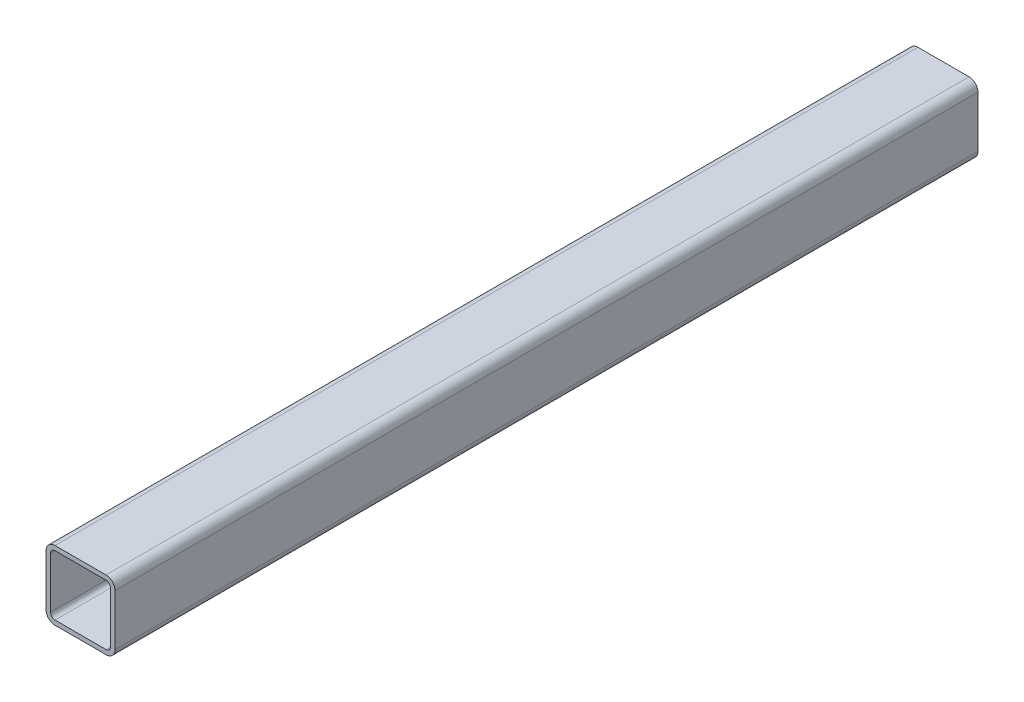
ISO-10303-21;
HEADER;
FILE_DESCRIPTION(('STEP AP214'),'2;1');
FILE_NAME('part.step','',(''),(''),'','','');
FILE_SCHEMA(('AUTOMOTIVE_DESIGN { 1 0 10303 214 1 1 1 1 }'));
ENDSEC;
DATA;
#1=APPLICATION_CONTEXT('core data for automotive mechanical design processes');
#2=APPLICATION_PROTOCOL_DEFINITION('international standard','automotive_design',2000,#1);
#3=PRODUCT_CONTEXT('',#1,'mechanical');
#4=PRODUCT('Part','Part','',(#3));
#5=PRODUCT_RELATED_PRODUCT_CATEGORY('part','',(#4));
#6=PRODUCT_DEFINITION_FORMATION('','',#4);
#7=PRODUCT_DEFINITION_CONTEXT('part definition',#1,'design');
#8=PRODUCT_DEFINITION('design','',#6,#7);
#9=PRODUCT_DEFINITION_SHAPE('','',#8);
#10=(LENGTH_UNIT() NAMED_UNIT(*) SI_UNIT(.MILLI.,.METRE.));
#11=(NAMED_UNIT(*) PLANE_ANGLE_UNIT() SI_UNIT($,.RADIAN.));
#12=(NAMED_UNIT(*) SI_UNIT($,.STERADIAN.) SOLID_ANGLE_UNIT());
#13=UNCERTAINTY_MEASURE_WITH_UNIT(LENGTH_MEASURE(1.E-05),#10,'distance_accuracy_value','');
#14=(GEOMETRIC_REPRESENTATION_CONTEXT(3) GLOBAL_UNCERTAINTY_ASSIGNED_CONTEXT((#13)) GLOBAL_UNIT_ASSIGNED_CONTEXT((#10,
#11,#12)) REPRESENTATION_CONTEXT('',''));
#15=CARTESIAN_POINT('',(0.,0.,0.));
#16=DIRECTION('',(0.,0.,1.));
#17=DIRECTION('',(1.,0.,0.));
#18=AXIS2_PLACEMENT_3D('',#15,#16,#17);
#19=CARTESIAN_POINT('',(34.8,35.95,500.));
#20=DIRECTION('',(0.,0.,1.));
#21=DIRECTION('',(1.,0.,0.));
#22=AXIS2_PLACEMENT_3D('',#19,#20,#21);
#23=PLANE('',#22);
#24=CARTESIAN_POINT('',(34.8,35.95,500.));
#25=DIRECTION('',(0.,0.,1.));
#26=DIRECTION('',(1.,0.,0.));
#27=AXIS2_PLACEMENT_3D('',#24,#25,#26);
#28=CIRCLE('',#27,5.2);
#29=CARTESIAN_POINT('',(40.,35.95,500.));
#30=VERTEX_POINT('',#29);
#31=CARTESIAN_POINT('',(34.8,41.15,500.));
#32=VERTEX_POINT('',#31);
#33=EDGE_CURVE('E208',#30,#32,#28,.T.);
#34=ORIENTED_EDGE('',*,*,#33,.T.);
#35=DIRECTION('',(-1.,0.,0.));
#36=VECTOR('',#35,1.);
#37=CARTESIAN_POINT('',(34.8,41.15,500.));
#38=LINE('',#37,#36);
#39=CARTESIAN_POINT('',(5.2,41.15,500.));
#40=VERTEX_POINT('',#39);
#41=EDGE_CURVE('E211',#32,#40,#38,.T.);
#42=ORIENTED_EDGE('',*,*,#41,.T.);
#43=CARTESIAN_POINT('',(5.2,35.95,500.));
#44=DIRECTION('',(0.,0.,1.));
#45=DIRECTION('',(1.,0.,0.));
#46=AXIS2_PLACEMENT_3D('',#43,#44,#45);
#47=CIRCLE('',#46,5.2);
#48=CARTESIAN_POINT('',(0.,35.95,500.));
#49=VERTEX_POINT('',#48);
#50=EDGE_CURVE('E214',#40,#49,#47,.T.);
#51=ORIENTED_EDGE('',*,*,#50,.T.);
#52=DIRECTION('',(0.,-1.,0.));
#53=VECTOR('',#52,1.);
#54=CARTESIAN_POINT('',(0.,6.35,500.));
#55=LINE('',#54,#53);
#56=CARTESIAN_POINT('',(0.,6.35,500.));
#57=VERTEX_POINT('',#56);
#58=EDGE_CURVE('E216',#49,#57,#55,.T.);
#59=ORIENTED_EDGE('',*,*,#58,.T.);
#60=CARTESIAN_POINT('',(5.2,6.35,500.));
#61=DIRECTION('',(0.,0.,1.));
#62=DIRECTION('',(1.,0.,0.));
#63=AXIS2_PLACEMENT_3D('',#60,#61,#62);
#64=CIRCLE('',#63,5.2);
#65=CARTESIAN_POINT('',(5.2,1.15,500.));
#66=VERTEX_POINT('',#65);
#67=EDGE_CURVE('E218',#57,#66,#64,.T.);
#68=ORIENTED_EDGE('',*,*,#67,.T.);
#69=DIRECTION('',(1.,0.,0.));
#70=VECTOR('',#69,1.);
#71=CARTESIAN_POINT('',(5.2,1.15,500.));
#72=LINE('',#71,#70);
#73=CARTESIAN_POINT('',(34.8,1.14999999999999,500.));
#74=VERTEX_POINT('',#73);
#75=EDGE_CURVE('E220',#66,#74,#72,.T.);
#76=ORIENTED_EDGE('',*,*,#75,.T.);
#77=CARTESIAN_POINT('',(34.8,6.34999999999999,500.));
#78=DIRECTION('',(0.,0.,1.));
#79=DIRECTION('',(1.,0.,0.));
#80=AXIS2_PLACEMENT_3D('',#77,#78,#79);
#81=CIRCLE('',#80,5.2);
#82=CARTESIAN_POINT('',(40.,6.35,500.));
#83=VERTEX_POINT('',#82);
#84=EDGE_CURVE('E222',#74,#83,#81,.T.);
#85=ORIENTED_EDGE('',*,*,#84,.T.);
#86=DIRECTION('',(0.,1.,0.));
#87=VECTOR('',#86,1.);
#88=CARTESIAN_POINT('',(40.,35.95,500.));
#89=LINE('',#88,#87);
#90=EDGE_CURVE('E224',#83,#30,#89,.T.);
#91=ORIENTED_EDGE('',*,*,#90,.T.);
#92=EDGE_LOOP('',(#34,#42,#51,#59,#68,#76,#85,#91));
#93=FACE_BOUND('',#92,.T.);
#94=DIRECTION('',(0.,-1.,0.));
#95=VECTOR('',#94,1.);
#96=CARTESIAN_POINT('',(2.6,6.35,500.));
#97=LINE('',#96,#95);
#98=CARTESIAN_POINT('',(2.6,35.95,500.));
#99=VERTEX_POINT('',#98);
#100=CARTESIAN_POINT('',(2.6,6.35,500.));
#101=VERTEX_POINT('',#100);
#102=EDGE_CURVE('E151',#99,#101,#97,.T.);
#103=ORIENTED_EDGE('',*,*,#102,.F.);
#104=CARTESIAN_POINT('',(5.2,35.95,500.));
#105=DIRECTION('',(0.,0.,1.));
#106=DIRECTION('',(1.,0.,0.));
#107=AXIS2_PLACEMENT_3D('',#104,#105,#106);
#108=CIRCLE('',#107,2.60000000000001);
#109=CARTESIAN_POINT('',(5.2,38.55,500.));
#110=VERTEX_POINT('',#109);
#111=EDGE_CURVE('E143',#110,#99,#108,.T.);
#112=ORIENTED_EDGE('',*,*,#111,.F.);
#113=DIRECTION('',(-1.,0.,0.));
#114=VECTOR('',#113,1.);
#115=CARTESIAN_POINT('',(34.8,38.55,500.));
#116=LINE('',#115,#114);
#117=CARTESIAN_POINT('',(34.8,38.55,500.));
#118=VERTEX_POINT('',#117);
#119=EDGE_CURVE('E176',#118,#110,#116,.T.);
#120=ORIENTED_EDGE('',*,*,#119,.F.);
#121=CARTESIAN_POINT('',(34.8,35.95,500.));
#122=DIRECTION('',(0.,0.,1.));
#123=DIRECTION('',(1.,0.,0.));
#124=AXIS2_PLACEMENT_3D('',#121,#122,#123);
#125=CIRCLE('',#124,2.59999999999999);
#126=CARTESIAN_POINT('',(37.4,35.95,500.));
#127=VERTEX_POINT('',#126);
#128=EDGE_CURVE('E174',#127,#118,#125,.T.);
#129=ORIENTED_EDGE('',*,*,#128,.F.);
#130=DIRECTION('',(0.,1.,0.));
#131=VECTOR('',#130,1.);
#132=CARTESIAN_POINT('',(37.4,35.95,500.));
#133=LINE('',#132,#131);
#134=CARTESIAN_POINT('',(37.4,6.35,500.));
#135=VERTEX_POINT('',#134);
#136=EDGE_CURVE('E172',#135,#127,#133,.T.);
#137=ORIENTED_EDGE('',*,*,#136,.F.);
#138=CARTESIAN_POINT('',(34.8,6.35,500.));
#139=DIRECTION('',(0.,0.,1.));
#140=DIRECTION('',(1.,0.,0.));
#141=AXIS2_PLACEMENT_3D('',#138,#139,#140);
#142=CIRCLE('',#141,2.6);
#143=CARTESIAN_POINT('',(34.8,3.75,500.));
#144=VERTEX_POINT('',#143);
#145=EDGE_CURVE('E170',#144,#135,#142,.T.);
#146=ORIENTED_EDGE('',*,*,#145,.F.);
#147=DIRECTION('',(1.,0.,0.));
#148=VECTOR('',#147,1.);
#149=CARTESIAN_POINT('',(5.2,3.75,500.));
#150=LINE('',#149,#148);
#151=CARTESIAN_POINT('',(5.2,3.75,500.));
#152=VERTEX_POINT('',#151);
#153=EDGE_CURVE('E166',#152,#144,#150,.T.);
#154=ORIENTED_EDGE('',*,*,#153,.F.);
#155=CARTESIAN_POINT('',(5.2,6.35,500.));
#156=DIRECTION('',(0.,0.,1.));
#157=DIRECTION('',(1.,0.,0.));
#158=AXIS2_PLACEMENT_3D('',#155,#156,#157);
#159=CIRCLE('',#158,2.6);
#160=EDGE_CURVE('E164',#101,#152,#159,.T.);
#161=ORIENTED_EDGE('',*,*,#160,.F.);
#162=EDGE_LOOP('',(#103,#112,#120,#129,#137,#146,#154,#161));
#163=FACE_BOUND('',#162,.T.);
#164=ADVANCED_FACE('F30',(#93,#163),#23,.T.);
#165=CARTESIAN_POINT('',(34.8,35.95,0.));
#166=DIRECTION('',(0.,0.,1.));
#167=DIRECTION('',(1.,0.,0.));
#168=AXIS2_PLACEMENT_3D('',#165,#166,#167);
#169=PLANE('',#168);
#170=CARTESIAN_POINT('',(34.8,35.95,0.));
#171=DIRECTION('',(0.,0.,1.));
#172=DIRECTION('',(1.,0.,0.));
#173=AXIS2_PLACEMENT_3D('',#170,#171,#172);
#174=CIRCLE('',#173,5.2);
#175=CARTESIAN_POINT('',(40.,35.95,0.));
#176=VERTEX_POINT('',#175);
#177=CARTESIAN_POINT('',(34.8,41.15,0.));
#178=VERTEX_POINT('',#177);
#179=EDGE_CURVE('E159',#176,#178,#174,.T.);
#180=ORIENTED_EDGE('',*,*,#179,.F.);
#181=DIRECTION('',(0.,1.,0.));
#182=VECTOR('',#181,1.);
#183=CARTESIAN_POINT('',(40.,35.95,0.));
#184=LINE('',#183,#182);
#185=CARTESIAN_POINT('',(40.,6.35,0.));
#186=VERTEX_POINT('',#185);
#187=EDGE_CURVE('E212',#186,#176,#184,.T.);
#188=ORIENTED_EDGE('',*,*,#187,.F.);
#189=CARTESIAN_POINT('',(34.8,6.34999999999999,0.));
#190=DIRECTION('',(0.,0.,1.));
#191=DIRECTION('',(1.,0.,0.));
#192=AXIS2_PLACEMENT_3D('',#189,#190,#191);
#193=CIRCLE('',#192,5.2);
#194=CARTESIAN_POINT('',(34.8,1.14999999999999,0.));
#195=VERTEX_POINT('',#194);
#196=EDGE_CURVE('E239',#195,#186,#193,.T.);
#197=ORIENTED_EDGE('',*,*,#196,.F.);
#198=DIRECTION('',(1.,0.,0.));
#199=VECTOR('',#198,1.);
#200=CARTESIAN_POINT('',(5.2,1.15,0.));
#201=LINE('',#200,#199);
#202=CARTESIAN_POINT('',(5.2,1.15,0.));
#203=VERTEX_POINT('',#202);
#204=EDGE_CURVE('E237',#203,#195,#201,.T.);
#205=ORIENTED_EDGE('',*,*,#204,.F.);
#206=CARTESIAN_POINT('',(5.2,6.35,0.));
#207=DIRECTION('',(0.,0.,1.));
#208=DIRECTION('',(1.,0.,0.));
#209=AXIS2_PLACEMENT_3D('',#206,#207,#208);
#210=CIRCLE('',#209,5.2);
#211=CARTESIAN_POINT('',(0.,6.35,0.));
#212=VERTEX_POINT('',#211);
#213=EDGE_CURVE('E235',#212,#203,#210,.T.);
#214=ORIENTED_EDGE('',*,*,#213,.F.);
#215=DIRECTION('',(0.,-1.,0.));
#216=VECTOR('',#215,1.);
#217=CARTESIAN_POINT('',(0.,6.35,0.));
#218=LINE('',#217,#216);
#219=CARTESIAN_POINT('',(0.,35.95,0.));
#220=VERTEX_POINT('',#219);
#221=EDGE_CURVE('E233',#220,#212,#218,.T.);
#222=ORIENTED_EDGE('',*,*,#221,.F.);
#223=CARTESIAN_POINT('',(5.2,35.95,0.));
#224=DIRECTION('',(0.,0.,1.));
#225=DIRECTION('',(1.,0.,0.));
#226=AXIS2_PLACEMENT_3D('',#223,#224,#225);
#227=CIRCLE('',#226,5.2);
#228=CARTESIAN_POINT('',(5.2,41.15,0.));
#229=VERTEX_POINT('',#228);
#230=EDGE_CURVE('E231',#229,#220,#227,.T.);
#231=ORIENTED_EDGE('',*,*,#230,.F.);
#232=DIRECTION('',(-1.,0.,0.));
#233=VECTOR('',#232,1.);
#234=CARTESIAN_POINT('',(34.8,41.15,0.));
#235=LINE('',#234,#233);
#236=EDGE_CURVE('E229',#178,#229,#235,.T.);
#237=ORIENTED_EDGE('',*,*,#236,.F.);
#238=EDGE_LOOP('',(#180,#188,#197,#205,#214,#222,#231,#237));
#239=FACE_BOUND('',#238,.T.);
#240=CARTESIAN_POINT('',(5.2,35.95,0.));
#241=DIRECTION('',(0.,0.,1.));
#242=DIRECTION('',(1.,0.,0.));
#243=AXIS2_PLACEMENT_3D('',#240,#241,#242);
#244=CIRCLE('',#243,2.60000000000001);
#245=CARTESIAN_POINT('',(5.2,38.55,0.));
#246=VERTEX_POINT('',#245);
#247=CARTESIAN_POINT('',(2.6,35.95,0.));
#248=VERTEX_POINT('',#247);
#249=EDGE_CURVE('E53',#246,#248,#244,.T.);
#250=ORIENTED_EDGE('',*,*,#249,.T.);
#251=DIRECTION('',(0.,-1.,0.));
#252=VECTOR('',#251,1.);
#253=CARTESIAN_POINT('',(2.6,6.35,0.));
#254=LINE('',#253,#252);
#255=CARTESIAN_POINT('',(2.6,6.35,0.));
#256=VERTEX_POINT('',#255);
#257=EDGE_CURVE('E158',#248,#256,#254,.T.);
#258=ORIENTED_EDGE('',*,*,#257,.T.);
#259=CARTESIAN_POINT('',(5.2,6.35,0.));
#260=DIRECTION('',(0.,0.,1.));
#261=DIRECTION('',(1.,0.,0.));
#262=AXIS2_PLACEMENT_3D('',#259,#260,#261);
#263=CIRCLE('',#262,2.6);
#264=CARTESIAN_POINT('',(5.2,3.75,0.));
#265=VERTEX_POINT('',#264);
#266=EDGE_CURVE('E180',#256,#265,#263,.T.);
#267=ORIENTED_EDGE('',*,*,#266,.T.);
#268=DIRECTION('',(1.,0.,0.));
#269=VECTOR('',#268,1.);
#270=CARTESIAN_POINT('',(5.2,3.75,0.));
#271=LINE('',#270,#269);
#272=CARTESIAN_POINT('',(34.8,3.75,0.));
#273=VERTEX_POINT('',#272);
#274=EDGE_CURVE('E183',#265,#273,#271,.T.);
#275=ORIENTED_EDGE('',*,*,#274,.T.);
#276=CARTESIAN_POINT('',(34.8,6.35,0.));
#277=DIRECTION('',(0.,0.,1.));
#278=DIRECTION('',(1.,0.,0.));
#279=AXIS2_PLACEMENT_3D('',#276,#277,#278);
#280=CIRCLE('',#279,2.6);
#281=CARTESIAN_POINT('',(37.4,6.35,0.));
#282=VERTEX_POINT('',#281);
#283=EDGE_CURVE('E186',#273,#282,#280,.T.);
#284=ORIENTED_EDGE('',*,*,#283,.T.);
#285=DIRECTION('',(0.,1.,0.));
#286=VECTOR('',#285,1.);
#287=CARTESIAN_POINT('',(37.4,35.95,0.));
#288=LINE('',#287,#286);
#289=CARTESIAN_POINT('',(37.4,35.95,0.));
#290=VERTEX_POINT('',#289);
#291=EDGE_CURVE('E189',#282,#290,#288,.T.);
#292=ORIENTED_EDGE('',*,*,#291,.T.);
#293=CARTESIAN_POINT('',(34.8,35.95,0.));
#294=DIRECTION('',(0.,0.,1.));
#295=DIRECTION('',(1.,0.,0.));
#296=AXIS2_PLACEMENT_3D('',#293,#294,#295);
#297=CIRCLE('',#296,2.59999999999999);
#298=CARTESIAN_POINT('',(34.8,38.55,0.));
#299=VERTEX_POINT('',#298);
#300=EDGE_CURVE('E192',#290,#299,#297,.T.);
#301=ORIENTED_EDGE('',*,*,#300,.T.);
#302=DIRECTION('',(-1.,0.,0.));
#303=VECTOR('',#302,1.);
#304=CARTESIAN_POINT('',(34.8,38.55,0.));
#305=LINE('',#304,#303);
#306=EDGE_CURVE('E152',#299,#246,#305,.T.);
#307=ORIENTED_EDGE('',*,*,#306,.T.);
#308=EDGE_LOOP('',(#250,#258,#267,#275,#284,#292,#301,#307));
#309=FACE_BOUND('',#308,.T.);
#310=ADVANCED_FACE('F269',(#239,#309),#169,.F.);
#311=CARTESIAN_POINT('',(34.8,35.95,500.));
#312=DIRECTION('',(0.,0.,-1.));
#313=DIRECTION('',(-1.,0.,0.));
#314=AXIS2_PLACEMENT_3D('',#311,#312,#313);
#315=CYLINDRICAL_SURFACE('',#314,5.2);
#316=ORIENTED_EDGE('',*,*,#179,.T.);
#317=DIRECTION('',(0.,0.,-1.));
#318=VECTOR('',#317,1.);
#319=CARTESIAN_POINT('',(34.8,41.15,500.));
#320=LINE('',#319,#318);
#321=EDGE_CURVE('E11',#32,#178,#320,.T.);
#322=ORIENTED_EDGE('',*,*,#321,.F.);
#323=ORIENTED_EDGE('',*,*,#33,.F.);
#324=DIRECTION('',(0.,0.,-1.));
#325=VECTOR('',#324,1.);
#326=CARTESIAN_POINT('',(40.,35.95,500.));
#327=LINE('',#326,#325);
#328=EDGE_CURVE('E226',#30,#176,#327,.T.);
#329=ORIENTED_EDGE('',*,*,#328,.T.);
#330=EDGE_LOOP('',(#316,#322,#323,#329));
#331=FACE_BOUND('',#330,.T.);
#332=ADVANCED_FACE('F32',(#331),#315,.T.);
#333=CARTESIAN_POINT('',(34.8,41.15,500.));
#334=DIRECTION('',(0.,-1.,0.));
#335=DIRECTION('',(1.,0.,0.));
#336=AXIS2_PLACEMENT_3D('',#333,#334,#335);
#337=PLANE('',#336);
#338=ORIENTED_EDGE('',*,*,#236,.T.);
#339=DIRECTION('',(0.,0.,-1.));
#340=VECTOR('',#339,1.);
#341=CARTESIAN_POINT('',(5.2,41.15,500.));
#342=LINE('',#341,#340);
#343=EDGE_CURVE('E38',#40,#229,#342,.T.);
#344=ORIENTED_EDGE('',*,*,#343,.F.);
#345=ORIENTED_EDGE('',*,*,#41,.F.);
#346=ORIENTED_EDGE('',*,*,#321,.T.);
#347=EDGE_LOOP('',(#338,#344,#345,#346));
#348=FACE_BOUND('',#347,.T.);
#349=ADVANCED_FACE('F286',(#348),#337,.F.);
#350=CARTESIAN_POINT('',(5.2,35.95,500.));
#351=DIRECTION('',(0.,0.,-1.));
#352=DIRECTION('',(-1.,0.,0.));
#353=AXIS2_PLACEMENT_3D('',#350,#351,#352);
#354=CYLINDRICAL_SURFACE('',#353,5.2);
#355=ORIENTED_EDGE('',*,*,#230,.T.);
#356=DIRECTION('',(0.,0.,-1.));
#357=VECTOR('',#356,1.);
#358=CARTESIAN_POINT('',(0.,35.95,500.));
#359=LINE('',#358,#357);
#360=EDGE_CURVE('E256',#49,#220,#359,.T.);
#361=ORIENTED_EDGE('',*,*,#360,.F.);
#362=ORIENTED_EDGE('',*,*,#50,.F.);
#363=ORIENTED_EDGE('',*,*,#343,.T.);
#364=EDGE_LOOP('',(#355,#361,#362,#363));
#365=FACE_BOUND('',#364,.T.);
#366=ADVANCED_FACE('F263',(#365),#354,.T.);
#367=CARTESIAN_POINT('',(0.,6.35,500.));
#368=DIRECTION('',(1.,0.,0.));
#369=DIRECTION('',(0.,1.,0.));
#370=AXIS2_PLACEMENT_3D('',#367,#368,#369);
#371=PLANE('',#370);
#372=ORIENTED_EDGE('',*,*,#221,.T.);
#373=DIRECTION('',(0.,0.,-1.));
#374=VECTOR('',#373,1.);
#375=CARTESIAN_POINT('',(0.,6.35,500.));
#376=LINE('',#375,#374);
#377=EDGE_CURVE('E253',#57,#212,#376,.T.);
#378=ORIENTED_EDGE('',*,*,#377,.F.);
#379=ORIENTED_EDGE('',*,*,#58,.F.);
#380=ORIENTED_EDGE('',*,*,#360,.T.);
#381=EDGE_LOOP('',(#372,#378,#379,#380));
#382=FACE_BOUND('',#381,.T.);
#383=ADVANCED_FACE('F275',(#382),#371,.F.);
#384=CARTESIAN_POINT('',(5.2,6.35,500.));
#385=DIRECTION('',(0.,0.,-1.));
#386=DIRECTION('',(-1.,0.,0.));
#387=AXIS2_PLACEMENT_3D('',#384,#385,#386);
#388=CYLINDRICAL_SURFACE('',#387,5.2);
#389=ORIENTED_EDGE('',*,*,#213,.T.);
#390=DIRECTION('',(0.,0.,-1.));
#391=VECTOR('',#390,1.);
#392=CARTESIAN_POINT('',(5.2,1.15,500.));
#393=LINE('',#392,#391);
#394=EDGE_CURVE('E250',#66,#203,#393,.T.);
#395=ORIENTED_EDGE('',*,*,#394,.F.);
#396=ORIENTED_EDGE('',*,*,#67,.F.);
#397=ORIENTED_EDGE('',*,*,#377,.T.);
#398=EDGE_LOOP('',(#389,#395,#396,#397));
#399=FACE_BOUND('',#398,.T.);
#400=ADVANCED_FACE('F279',(#399),#388,.T.);
#401=CARTESIAN_POINT('',(5.2,1.15,500.));
#402=DIRECTION('',(0.,1.,0.));
#403=DIRECTION('',(-1.,0.,0.));
#404=AXIS2_PLACEMENT_3D('',#401,#402,#403);
#405=PLANE('',#404);
#406=ORIENTED_EDGE('',*,*,#204,.T.);
#407=DIRECTION('',(0.,0.,-1.));
#408=VECTOR('',#407,1.);
#409=CARTESIAN_POINT('',(34.8,1.14999999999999,500.));
#410=LINE('',#409,#408);
#411=EDGE_CURVE('E247',#74,#195,#410,.T.);
#412=ORIENTED_EDGE('',*,*,#411,.F.);
#413=ORIENTED_EDGE('',*,*,#75,.F.);
#414=ORIENTED_EDGE('',*,*,#394,.T.);
#415=EDGE_LOOP('',(#406,#412,#413,#414));
#416=FACE_BOUND('',#415,.T.);
#417=ADVANCED_FACE('F299',(#416),#405,.F.);
#418=CARTESIAN_POINT('',(34.8,6.34999999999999,500.));
#419=DIRECTION('',(0.,0.,-1.));
#420=DIRECTION('',(-1.,0.,0.));
#421=AXIS2_PLACEMENT_3D('',#418,#419,#420);
#422=CYLINDRICAL_SURFACE('',#421,5.2);
#423=ORIENTED_EDGE('',*,*,#196,.T.);
#424=DIRECTION('',(0.,0.,-1.));
#425=VECTOR('',#424,1.);
#426=CARTESIAN_POINT('',(40.,6.35,500.));
#427=LINE('',#426,#425);
#428=EDGE_CURVE('E244',#83,#186,#427,.T.);
#429=ORIENTED_EDGE('',*,*,#428,.F.);
#430=ORIENTED_EDGE('',*,*,#84,.F.);
#431=ORIENTED_EDGE('',*,*,#411,.T.);
#432=EDGE_LOOP('',(#423,#429,#430,#431));
#433=FACE_BOUND('',#432,.T.);
#434=ADVANCED_FACE('F297',(#433),#422,.T.);
#435=CARTESIAN_POINT('',(40.,35.95,500.));
#436=DIRECTION('',(-1.,0.,0.));
#437=DIRECTION('',(0.,-1.,0.));
#438=AXIS2_PLACEMENT_3D('',#435,#436,#437);
#439=PLANE('',#438);
#440=ORIENTED_EDGE('',*,*,#187,.T.);
#441=ORIENTED_EDGE('',*,*,#328,.F.);
#442=ORIENTED_EDGE('',*,*,#90,.F.);
#443=ORIENTED_EDGE('',*,*,#428,.T.);
#444=EDGE_LOOP('',(#440,#441,#442,#443));
#445=FACE_BOUND('',#444,.T.);
#446=ADVANCED_FACE('F292',(#445),#439,.F.);
#447=CARTESIAN_POINT('',(5.2,35.95,500.));
#448=DIRECTION('',(0.,0.,-1.));
#449=DIRECTION('',(-1.,0.,0.));
#450=AXIS2_PLACEMENT_3D('',#447,#448,#449);
#451=CYLINDRICAL_SURFACE('',#450,2.60000000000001);
#452=ORIENTED_EDGE('',*,*,#249,.F.);
#453=DIRECTION('',(0.,0.,-1.));
#454=VECTOR('',#453,1.);
#455=CARTESIAN_POINT('',(5.2,38.55,500.));
#456=LINE('',#455,#454);
#457=EDGE_CURVE('E147',#110,#246,#456,.T.);
#458=ORIENTED_EDGE('',*,*,#457,.F.);
#459=ORIENTED_EDGE('',*,*,#111,.T.);
#460=DIRECTION('',(0.,0.,-1.));
#461=VECTOR('',#460,1.);
#462=CARTESIAN_POINT('',(2.6,35.95,500.));
#463=LINE('',#462,#461);
#464=EDGE_CURVE('E146',#99,#248,#463,.T.);
#465=ORIENTED_EDGE('',*,*,#464,.T.);
#466=EDGE_LOOP('',(#452,#458,#459,#465));
#467=FACE_BOUND('',#466,.T.);
#468=ADVANCED_FACE('F145',(#467),#451,.F.);
#469=CARTESIAN_POINT('',(2.6,6.35,500.));
#470=DIRECTION('',(1.,0.,0.));
#471=DIRECTION('',(0.,0.,-1.));
#472=AXIS2_PLACEMENT_3D('',#469,#470,#471);
#473=PLANE('',#472);
#474=ORIENTED_EDGE('',*,*,#257,.F.);
#475=ORIENTED_EDGE('',*,*,#464,.F.);
#476=ORIENTED_EDGE('',*,*,#102,.T.);
#477=DIRECTION('',(0.,0.,-1.));
#478=VECTOR('',#477,1.);
#479=CARTESIAN_POINT('',(2.6,6.35,500.));
#480=LINE('',#479,#478);
#481=EDGE_CURVE('E160',#101,#256,#480,.T.);
#482=ORIENTED_EDGE('',*,*,#481,.T.);
#483=EDGE_LOOP('',(#474,#475,#476,#482));
#484=FACE_BOUND('',#483,.T.);
#485=ADVANCED_FACE('F155',(#484),#473,.T.);
#486=CARTESIAN_POINT('',(5.2,6.35,500.));
#487=DIRECTION('',(0.,0.,-1.));
#488=DIRECTION('',(-1.,0.,0.));
#489=AXIS2_PLACEMENT_3D('',#486,#487,#488);
#490=CYLINDRICAL_SURFACE('',#489,2.6);
#491=ORIENTED_EDGE('',*,*,#266,.F.);
#492=ORIENTED_EDGE('',*,*,#481,.F.);
#493=ORIENTED_EDGE('',*,*,#160,.T.);
#494=DIRECTION('',(0.,0.,-1.));
#495=VECTOR('',#494,1.);
#496=CARTESIAN_POINT('',(5.2,3.75,500.));
#497=LINE('',#496,#495);
#498=EDGE_CURVE('E205',#152,#265,#497,.T.);
#499=ORIENTED_EDGE('',*,*,#498,.T.);
#500=EDGE_LOOP('',(#491,#492,#493,#499));
#501=FACE_BOUND('',#500,.T.);
#502=ADVANCED_FACE('F324',(#501),#490,.F.);
#503=CARTESIAN_POINT('',(5.2,3.75,500.));
#504=DIRECTION('',(0.,1.,0.));
#505=DIRECTION('',(0.,0.,1.));
#506=AXIS2_PLACEMENT_3D('',#503,#504,#505);
#507=PLANE('',#506);
#508=ORIENTED_EDGE('',*,*,#274,.F.);
#509=ORIENTED_EDGE('',*,*,#498,.F.);
#510=ORIENTED_EDGE('',*,*,#153,.T.);
#511=DIRECTION('',(0.,0.,-1.));
#512=VECTOR('',#511,1.);
#513=CARTESIAN_POINT('',(34.8,3.75,500.));
#514=LINE('',#513,#512);
#515=EDGE_CURVE('E203',#144,#273,#514,.T.);
#516=ORIENTED_EDGE('',*,*,#515,.T.);
#517=EDGE_LOOP('',(#508,#509,#510,#516));
#518=FACE_BOUND('',#517,.T.);
#519=ADVANCED_FACE('F328',(#518),#507,.T.);
#520=CARTESIAN_POINT('',(34.8,6.35,500.));
#521=DIRECTION('',(0.,0.,-1.));
#522=DIRECTION('',(-1.,0.,0.));
#523=AXIS2_PLACEMENT_3D('',#520,#521,#522);
#524=CYLINDRICAL_SURFACE('',#523,2.6);
#525=ORIENTED_EDGE('',*,*,#283,.F.);
#526=ORIENTED_EDGE('',*,*,#515,.F.);
#527=ORIENTED_EDGE('',*,*,#145,.T.);
#528=DIRECTION('',(0.,0.,-1.));
#529=VECTOR('',#528,1.);
#530=CARTESIAN_POINT('',(37.4,6.35,500.));
#531=LINE('',#530,#529);
#532=EDGE_CURVE('E201',#135,#282,#531,.T.);
#533=ORIENTED_EDGE('',*,*,#532,.T.);
#534=EDGE_LOOP('',(#525,#526,#527,#533));
#535=FACE_BOUND('',#534,.T.);
#536=ADVANCED_FACE('F334',(#535),#524,.F.);
#537=CARTESIAN_POINT('',(37.4,35.95,500.));
#538=DIRECTION('',(-1.,0.,0.));
#539=DIRECTION('',(0.,-1.,0.));
#540=AXIS2_PLACEMENT_3D('',#537,#538,#539);
#541=PLANE('',#540);
#542=ORIENTED_EDGE('',*,*,#291,.F.);
#543=ORIENTED_EDGE('',*,*,#532,.F.);
#544=ORIENTED_EDGE('',*,*,#136,.T.);
#545=DIRECTION('',(0.,0.,-1.));
#546=VECTOR('',#545,1.);
#547=CARTESIAN_POINT('',(37.4,35.95,500.));
#548=LINE('',#547,#546);
#549=EDGE_CURVE('E199',#127,#290,#548,.T.);
#550=ORIENTED_EDGE('',*,*,#549,.T.);
#551=EDGE_LOOP('',(#542,#543,#544,#550));
#552=FACE_BOUND('',#551,.T.);
#553=ADVANCED_FACE('F338',(#552),#541,.T.);
#554=CARTESIAN_POINT('',(34.8,35.95,500.));
#555=DIRECTION('',(0.,0.,-1.));
#556=DIRECTION('',(-1.,0.,0.));
#557=AXIS2_PLACEMENT_3D('',#554,#555,#556);
#558=CYLINDRICAL_SURFACE('',#557,2.59999999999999);
#559=ORIENTED_EDGE('',*,*,#300,.F.);
#560=ORIENTED_EDGE('',*,*,#549,.F.);
#561=ORIENTED_EDGE('',*,*,#128,.T.);
#562=DIRECTION('',(0.,0.,-1.));
#563=VECTOR('',#562,1.);
#564=CARTESIAN_POINT('',(34.8,38.55,500.));
#565=LINE('',#564,#563);
#566=EDGE_CURVE('E45',#118,#299,#565,.T.);
#567=ORIENTED_EDGE('',*,*,#566,.T.);
#568=EDGE_LOOP('',(#559,#560,#561,#567));
#569=FACE_BOUND('',#568,.T.);
#570=ADVANCED_FACE('F342',(#569),#558,.F.);
#571=CARTESIAN_POINT('',(34.8,38.55,500.));
#572=DIRECTION('',(0.,-1.,0.));
#573=DIRECTION('',(0.,0.,-1.));
#574=AXIS2_PLACEMENT_3D('',#571,#572,#573);
#575=PLANE('',#574);
#576=ORIENTED_EDGE('',*,*,#306,.F.);
#577=ORIENTED_EDGE('',*,*,#566,.F.);
#578=ORIENTED_EDGE('',*,*,#119,.T.);
#579=ORIENTED_EDGE('',*,*,#457,.T.);
#580=EDGE_LOOP('',(#576,#577,#578,#579));
#581=FACE_BOUND('',#580,.T.);
#582=ADVANCED_FACE('F346',(#581),#575,.T.);
#583=CLOSED_SHELL('',(#164,#310,#332,#349,#366,#383,#400,#417,#434,#446,#468,#485,#502,#519,
#536,#553,#570,#582));
#584=MANIFOLD_SOLID_BREP('B2',#583);
#585=ADVANCED_BREP_SHAPE_REPRESENTATION('',(#18,#584),#14);
#586=SHAPE_DEFINITION_REPRESENTATION(#9,#585);
ENDSEC;
END-ISO-10303-21;
